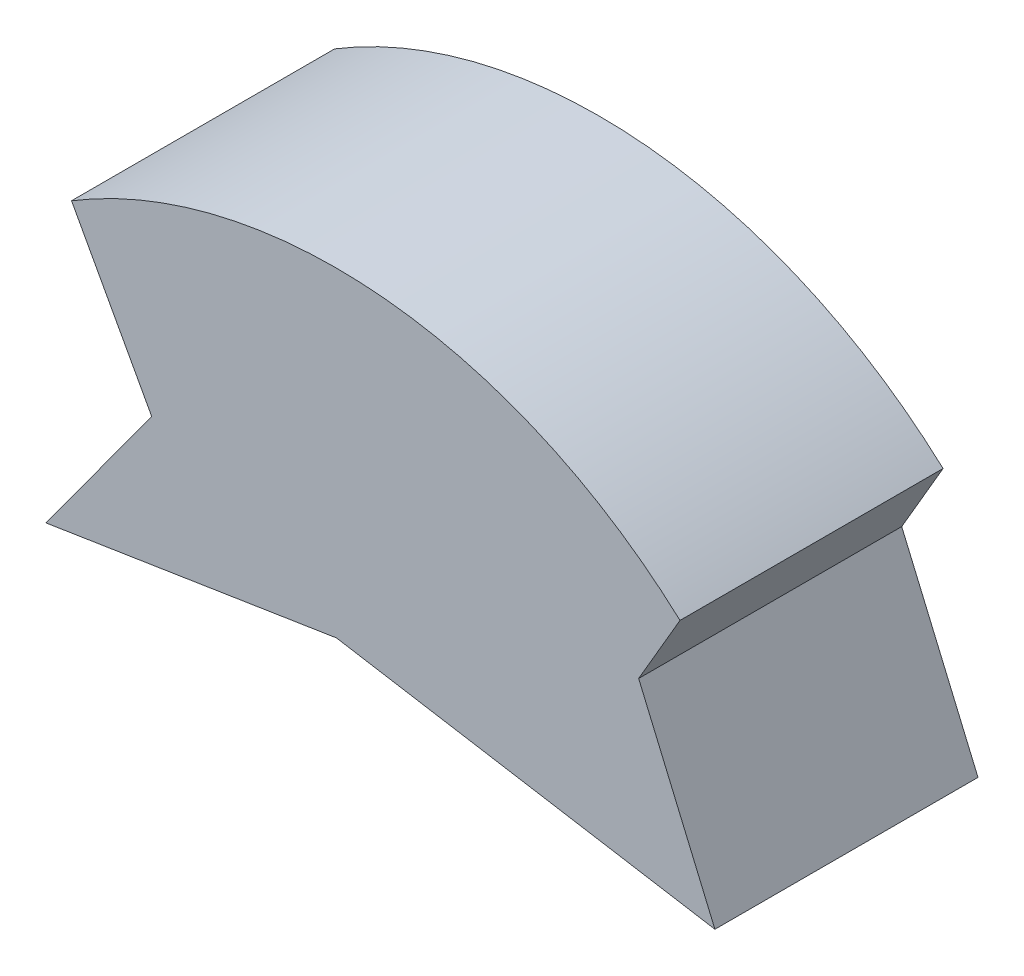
ISO-10303-21;
HEADER;
FILE_DESCRIPTION(('STEP AP214'),'2;1');
FILE_NAME('part.step','',(''),(''),'','','');
FILE_SCHEMA(('AUTOMOTIVE_DESIGN { 1 0 10303 214 1 1 1 1 }'));
ENDSEC;
DATA;
#1=APPLICATION_CONTEXT('core data for automotive mechanical design processes');
#2=APPLICATION_PROTOCOL_DEFINITION('international standard','automotive_design',2000,#1);
#3=PRODUCT_CONTEXT('',#1,'mechanical');
#4=PRODUCT('Part','Part','',(#3));
#5=PRODUCT_RELATED_PRODUCT_CATEGORY('part','',(#4));
#6=PRODUCT_DEFINITION_FORMATION('','',#4);
#7=PRODUCT_DEFINITION_CONTEXT('part definition',#1,'design');
#8=PRODUCT_DEFINITION('design','',#6,#7);
#9=PRODUCT_DEFINITION_SHAPE('','',#8);
#10=(LENGTH_UNIT() NAMED_UNIT(*) SI_UNIT(.MILLI.,.METRE.));
#11=(NAMED_UNIT(*) PLANE_ANGLE_UNIT() SI_UNIT($,.RADIAN.));
#12=(NAMED_UNIT(*) SI_UNIT($,.STERADIAN.) SOLID_ANGLE_UNIT());
#13=UNCERTAINTY_MEASURE_WITH_UNIT(LENGTH_MEASURE(1.E-05),#10,'distance_accuracy_value','');
#14=(GEOMETRIC_REPRESENTATION_CONTEXT(3) GLOBAL_UNCERTAINTY_ASSIGNED_CONTEXT((#13)) GLOBAL_UNIT_ASSIGNED_CONTEXT((#10,
#11,#12)) REPRESENTATION_CONTEXT('',''));
#15=CARTESIAN_POINT('',(0.,0.,0.));
#16=DIRECTION('',(0.,0.,1.));
#17=DIRECTION('',(1.,0.,0.));
#18=AXIS2_PLACEMENT_3D('',#15,#16,#17);
#19=CARTESIAN_POINT('',(-291.965491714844,-35.6125349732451,8.));
#20=DIRECTION('',(-0.155237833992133,0.987877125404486,0.));
#21=DIRECTION('',(-0.987877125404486,-0.155237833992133,0.));
#22=AXIS2_PLACEMENT_3D('',#19,#20,#21);
#23=PLANE('',#22);
#24=DIRECTION('',(0.987877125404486,0.155237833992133,0.));
#25=VECTOR('',#24,1.);
#26=CARTESIAN_POINT('',(-291.965491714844,-35.6125349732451,-8.));
#27=LINE('',#26,#25);
#28=CARTESIAN_POINT('',(-291.965491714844,-35.6125349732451,-8.));
#29=VERTEX_POINT('',#28);
#30=CARTESIAN_POINT('',(-274.303003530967,-32.8370011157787,-8.));
#31=VERTEX_POINT('',#30);
#32=EDGE_CURVE('E95',#29,#31,#27,.T.);
#33=ORIENTED_EDGE('',*,*,#32,.T.);
#34=DIRECTION('',(0.,0.,-1.));
#35=VECTOR('',#34,1.);
#36=CARTESIAN_POINT('',(-274.303003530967,-32.8370011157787,8.));
#37=LINE('',#36,#35);
#38=CARTESIAN_POINT('',(-274.303003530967,-32.8370011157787,8.));
#39=VERTEX_POINT('',#38);
#40=EDGE_CURVE('E11',#39,#31,#37,.T.);
#41=ORIENTED_EDGE('',*,*,#40,.F.);
#42=DIRECTION('',(0.987877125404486,0.155237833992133,0.));
#43=VECTOR('',#42,1.);
#44=CARTESIAN_POINT('',(-291.965491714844,-35.6125349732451,8.));
#45=LINE('',#44,#43);
#46=CARTESIAN_POINT('',(-291.965491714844,-35.6125349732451,8.));
#47=VERTEX_POINT('',#46);
#48=EDGE_CURVE('E120',#47,#39,#45,.T.);
#49=ORIENTED_EDGE('',*,*,#48,.F.);
#50=DIRECTION('',(0.,0.,-1.));
#51=VECTOR('',#50,1.);
#52=CARTESIAN_POINT('',(-291.965491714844,-35.6125349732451,8.));
#53=LINE('',#52,#51);
#54=EDGE_CURVE('E108',#47,#29,#53,.T.);
#55=ORIENTED_EDGE('',*,*,#54,.T.);
#56=EDGE_LOOP('',(#33,#41,#49,#55));
#57=FACE_BOUND('',#56,.T.);
#58=ADVANCED_FACE('F33',(#57),#23,.F.);
#59=CARTESIAN_POINT('',(-274.303003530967,-32.8370011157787,8.));
#60=DIRECTION('',(0.164398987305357,0.986393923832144,0.));
#61=DIRECTION('',(-0.986393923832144,0.164398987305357,0.));
#62=AXIS2_PLACEMENT_3D('',#59,#60,#61);
#63=PLANE('',#62);
#64=DIRECTION('',(0.986393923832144,-0.164398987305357,0.));
#65=VECTOR('',#64,1.);
#66=CARTESIAN_POINT('',(-274.303003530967,-32.8370011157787,-8.));
#67=LINE('',#66,#65);
#68=CARTESIAN_POINT('',(-251.281554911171,-36.673909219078,-8.));
#69=VERTEX_POINT('',#68);
#70=EDGE_CURVE('E91',#31,#69,#67,.T.);
#71=ORIENTED_EDGE('',*,*,#70,.T.);
#72=DIRECTION('',(0.,0.,-1.));
#73=VECTOR('',#72,1.);
#74=CARTESIAN_POINT('',(-251.281554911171,-36.673909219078,8.));
#75=LINE('',#74,#73);
#76=CARTESIAN_POINT('',(-251.281554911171,-36.673909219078,8.));
#77=VERTEX_POINT('',#76);
#78=EDGE_CURVE('E40',#77,#69,#75,.T.);
#79=ORIENTED_EDGE('',*,*,#78,.F.);
#80=DIRECTION('',(0.986393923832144,-0.164398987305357,0.));
#81=VECTOR('',#80,1.);
#82=CARTESIAN_POINT('',(-274.303003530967,-32.8370011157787,8.));
#83=LINE('',#82,#81);
#84=EDGE_CURVE('E104',#39,#77,#83,.T.);
#85=ORIENTED_EDGE('',*,*,#84,.F.);
#86=ORIENTED_EDGE('',*,*,#40,.T.);
#87=EDGE_LOOP('',(#71,#79,#85,#86));
#88=FACE_BOUND('',#87,.T.);
#89=ADVANCED_FACE('F103',(#88),#63,.F.);
#90=CARTESIAN_POINT('',(-251.281554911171,-36.673909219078,8.));
#91=DIRECTION('',(-0.920009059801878,-0.391897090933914,0.));
#92=DIRECTION('',(0.391897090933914,-0.920009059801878,0.));
#93=AXIS2_PLACEMENT_3D('',#90,#91,#92);
#94=PLANE('',#93);
#95=DIRECTION('',(-0.391897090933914,0.920009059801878,0.));
#96=VECTOR('',#95,1.);
#97=CARTESIAN_POINT('',(-251.281554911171,-36.673909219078,-8.));
#98=LINE('',#97,#96);
#99=CARTESIAN_POINT('',(-255.920701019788,-25.7831510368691,-8.));
#100=VERTEX_POINT('',#99);
#101=EDGE_CURVE('E97',#69,#100,#98,.T.);
#102=ORIENTED_EDGE('',*,*,#101,.T.);
#103=DIRECTION('',(0.,0.,-1.));
#104=VECTOR('',#103,1.);
#105=CARTESIAN_POINT('',(-255.920701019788,-25.7831510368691,8.));
#106=LINE('',#105,#104);
#107=CARTESIAN_POINT('',(-255.920701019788,-25.7831510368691,8.));
#108=VERTEX_POINT('',#107);
#109=EDGE_CURVE('E141',#108,#100,#106,.T.);
#110=ORIENTED_EDGE('',*,*,#109,.F.);
#111=DIRECTION('',(-0.391897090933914,0.920009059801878,0.));
#112=VECTOR('',#111,1.);
#113=CARTESIAN_POINT('',(-251.281554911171,-36.673909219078,8.));
#114=LINE('',#113,#112);
#115=EDGE_CURVE('E123',#77,#108,#114,.T.);
#116=ORIENTED_EDGE('',*,*,#115,.F.);
#117=ORIENTED_EDGE('',*,*,#78,.T.);
#118=EDGE_LOOP('',(#102,#110,#116,#117));
#119=FACE_BOUND('',#118,.T.);
#120=ADVANCED_FACE('F145',(#119),#94,.F.);
#121=CARTESIAN_POINT('',(-255.920701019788,-25.7831510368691,8.));
#122=DIRECTION('',(-0.864088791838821,0.50333940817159,0.));
#123=DIRECTION('',(-0.50333940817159,-0.864088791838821,0.));
#124=AXIS2_PLACEMENT_3D('',#121,#122,#123);
#125=PLANE('',#124);
#126=DIRECTION('',(0.50333940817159,0.864088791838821,0.));
#127=VECTOR('',#126,1.);
#128=CARTESIAN_POINT('',(-255.920701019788,-25.7831510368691,-8.));
#129=LINE('',#128,#127);
#130=CARTESIAN_POINT('',(-253.405577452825,-21.4654082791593,-8.));
#131=VERTEX_POINT('',#130);
#132=EDGE_CURVE('E112',#100,#131,#129,.T.);
#133=ORIENTED_EDGE('',*,*,#132,.T.);
#134=DIRECTION('',(0.,0.,-1.));
#135=VECTOR('',#134,1.);
#136=CARTESIAN_POINT('',(-253.405577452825,-21.4654082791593,8.));
#137=LINE('',#136,#135);
#138=CARTESIAN_POINT('',(-253.405577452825,-21.4654082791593,8.));
#139=VERTEX_POINT('',#138);
#140=EDGE_CURVE('E138',#139,#131,#137,.T.);
#141=ORIENTED_EDGE('',*,*,#140,.F.);
#142=DIRECTION('',(0.50333940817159,0.864088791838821,0.));
#143=VECTOR('',#142,1.);
#144=CARTESIAN_POINT('',(-255.920701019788,-25.7831510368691,8.));
#145=LINE('',#144,#143);
#146=EDGE_CURVE('E125',#108,#139,#145,.T.);
#147=ORIENTED_EDGE('',*,*,#146,.F.);
#148=ORIENTED_EDGE('',*,*,#109,.T.);
#149=EDGE_LOOP('',(#133,#141,#147,#148));
#150=FACE_BOUND('',#149,.T.);
#151=ADVANCED_FACE('F153',(#150),#125,.F.);
#152=CARTESIAN_POINT('',(-274.31005449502,-44.3565165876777,8.));
#153=DIRECTION('',(0.,0.,-1.));
#154=DIRECTION('',(-1.,0.,0.));
#155=AXIS2_PLACEMENT_3D('',#152,#153,#154);
#156=CYLINDRICAL_SURFACE('',#155,31.);
#157=CARTESIAN_POINT('',(-274.31005449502,-44.3565165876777,-8.));
#158=DIRECTION('',(0.,0.,1.));
#159=DIRECTION('',(1.,0.,0.));
#160=AXIS2_PLACEMENT_3D('',#157,#158,#159);
#161=CIRCLE('',#160,31.);
#162=CARTESIAN_POINT('',(-290.412227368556,-17.8665179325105,-8.));
#163=VERTEX_POINT('',#162);
#164=EDGE_CURVE('E114',#131,#163,#161,.T.);
#165=ORIENTED_EDGE('',*,*,#164,.T.);
#166=DIRECTION('',(0.,0.,-1.));
#167=VECTOR('',#166,1.);
#168=CARTESIAN_POINT('',(-290.412227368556,-17.8665179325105,8.));
#169=LINE('',#168,#167);
#170=CARTESIAN_POINT('',(-290.412227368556,-17.8665179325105,8.));
#171=VERTEX_POINT('',#170);
#172=EDGE_CURVE('E135',#171,#163,#169,.T.);
#173=ORIENTED_EDGE('',*,*,#172,.F.);
#174=CARTESIAN_POINT('',(-274.31005449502,-44.3565165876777,8.));
#175=DIRECTION('',(0.,0.,1.));
#176=DIRECTION('',(1.,0.,0.));
#177=AXIS2_PLACEMENT_3D('',#174,#175,#176);
#178=CIRCLE('',#177,31.);
#179=EDGE_CURVE('E127',#139,#171,#178,.T.);
#180=ORIENTED_EDGE('',*,*,#179,.F.);
#181=ORIENTED_EDGE('',*,*,#140,.T.);
#182=EDGE_LOOP('',(#165,#173,#180,#181));
#183=FACE_BOUND('',#182,.T.);
#184=ADVANCED_FACE('F156',(#183),#156,.T.);
#185=CARTESIAN_POINT('',(-290.412227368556,-17.8665179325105,8.));
#186=DIRECTION('',(0.877575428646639,0.479438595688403,0.));
#187=DIRECTION('',(-0.479438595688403,0.877575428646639,0.));
#188=AXIS2_PLACEMENT_3D('',#185,#186,#187);
#189=PLANE('',#188);
#190=DIRECTION('',(0.479438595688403,-0.877575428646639,0.));
#191=VECTOR('',#190,1.);
#192=CARTESIAN_POINT('',(-290.412227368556,-17.8665179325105,-8.));
#193=LINE('',#192,#191);
#194=CARTESIAN_POINT('',(-285.538020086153,-26.7883790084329,-8.));
#195=VERTEX_POINT('',#194);
#196=EDGE_CURVE('E116',#163,#195,#193,.T.);
#197=ORIENTED_EDGE('',*,*,#196,.T.);
#198=DIRECTION('',(0.,0.,-1.));
#199=VECTOR('',#198,1.);
#200=CARTESIAN_POINT('',(-285.538020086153,-26.7883790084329,8.));
#201=LINE('',#200,#199);
#202=CARTESIAN_POINT('',(-285.538020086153,-26.7883790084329,8.));
#203=VERTEX_POINT('',#202);
#204=EDGE_CURVE('E132',#203,#195,#201,.T.);
#205=ORIENTED_EDGE('',*,*,#204,.F.);
#206=DIRECTION('',(0.479438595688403,-0.877575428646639,0.));
#207=VECTOR('',#206,1.);
#208=CARTESIAN_POINT('',(-290.412227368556,-17.8665179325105,8.));
#209=LINE('',#208,#207);
#210=EDGE_CURVE('E52',#171,#203,#209,.T.);
#211=ORIENTED_EDGE('',*,*,#210,.F.);
#212=ORIENTED_EDGE('',*,*,#172,.T.);
#213=EDGE_LOOP('',(#197,#205,#211,#212));
#214=FACE_BOUND('',#213,.T.);
#215=ADVANCED_FACE('F159',(#214),#189,.F.);
#216=CARTESIAN_POINT('',(-285.538020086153,-26.7883790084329,8.));
#217=DIRECTION('',(0.80830433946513,-0.588764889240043,0.));
#218=DIRECTION('',(0.588764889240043,0.80830433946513,0.));
#219=AXIS2_PLACEMENT_3D('',#216,#217,#218);
#220=PLANE('',#219);
#221=DIRECTION('',(-0.588764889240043,-0.80830433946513,0.));
#222=VECTOR('',#221,1.);
#223=CARTESIAN_POINT('',(-285.538020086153,-26.7883790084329,-8.));
#224=LINE('',#223,#222);
#225=EDGE_CURVE('E118',#195,#29,#224,.T.);
#226=ORIENTED_EDGE('',*,*,#225,.T.);
#227=ORIENTED_EDGE('',*,*,#54,.F.);
#228=DIRECTION('',(-0.588764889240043,-0.80830433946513,0.));
#229=VECTOR('',#228,1.);
#230=CARTESIAN_POINT('',(-285.538020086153,-26.7883790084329,8.));
#231=LINE('',#230,#229);
#232=EDGE_CURVE('E47',#203,#47,#231,.T.);
#233=ORIENTED_EDGE('',*,*,#232,.F.);
#234=ORIENTED_EDGE('',*,*,#204,.T.);
#235=EDGE_LOOP('',(#226,#227,#233,#234));
#236=FACE_BOUND('',#235,.T.);
#237=ADVANCED_FACE('F161',(#236),#220,.F.);
#238=CARTESIAN_POINT('',(-274.31005449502,-44.3565165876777,8.));
#239=DIRECTION('',(0.,0.,1.));
#240=DIRECTION('',(1.,0.,0.));
#241=AXIS2_PLACEMENT_3D('',#238,#239,#240);
#242=PLANE('',#241);
#243=ORIENTED_EDGE('',*,*,#48,.T.);
#244=ORIENTED_EDGE('',*,*,#84,.T.);
#245=ORIENTED_EDGE('',*,*,#115,.T.);
#246=ORIENTED_EDGE('',*,*,#146,.T.);
#247=ORIENTED_EDGE('',*,*,#179,.T.);
#248=ORIENTED_EDGE('',*,*,#210,.T.);
#249=ORIENTED_EDGE('',*,*,#232,.T.);
#250=EDGE_LOOP('',(#243,#244,#245,#246,#247,#248,#249));
#251=FACE_BOUND('',#250,.T.);
#252=ADVANCED_FACE('F148',(#251),#242,.T.);
#253=CARTESIAN_POINT('',(-274.31005449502,-44.3565165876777,-8.));
#254=DIRECTION('',(0.,0.,1.));
#255=DIRECTION('',(1.,0.,0.));
#256=AXIS2_PLACEMENT_3D('',#253,#254,#255);
#257=PLANE('',#256);
#258=ORIENTED_EDGE('',*,*,#32,.F.);
#259=ORIENTED_EDGE('',*,*,#225,.F.);
#260=ORIENTED_EDGE('',*,*,#196,.F.);
#261=ORIENTED_EDGE('',*,*,#164,.F.);
#262=ORIENTED_EDGE('',*,*,#132,.F.);
#263=ORIENTED_EDGE('',*,*,#101,.F.);
#264=ORIENTED_EDGE('',*,*,#70,.F.);
#265=EDGE_LOOP('',(#258,#259,#260,#261,#262,#263,#264));
#266=FACE_BOUND('',#265,.T.);
#267=ADVANCED_FACE('F92',(#266),#257,.F.);
#268=CLOSED_SHELL('',(#58,#89,#120,#151,#184,#215,#237,#252,#267));
#269=MANIFOLD_SOLID_BREP('B2',#268);
#270=ADVANCED_BREP_SHAPE_REPRESENTATION('',(#18,#269),#14);
#271=SHAPE_DEFINITION_REPRESENTATION(#9,#270);
ENDSEC;
END-ISO-10303-21;
